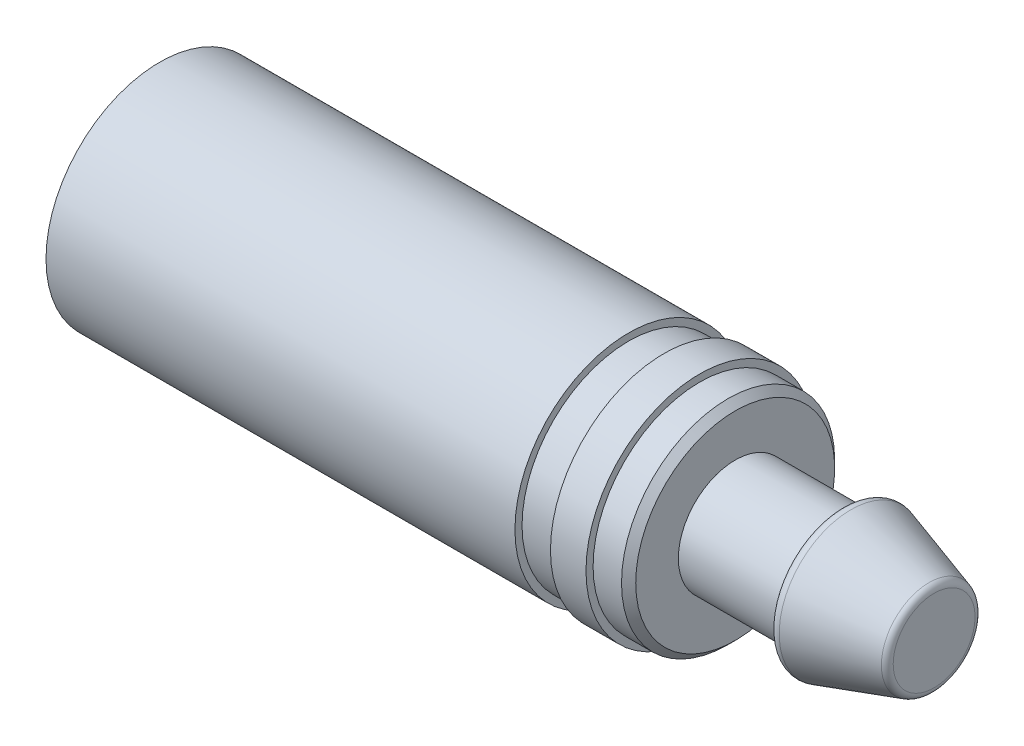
from build123d import *

# Parameters (mm, degrees)
REDONDEO1_R   = 1
CHAFL_N1_SIZE = 1


with BuildPart() as part:
    # Croquis1 → Revoluci_n1 (revolve)
    with BuildSketch(Plane.XY, mode=Mode.PRIVATE) as revoluci_n1_sk:
        Polygon((0, 0), (0, 16), (66, 16), (66, 15), (71, 15), (71, 16), (76, 16), (76, 15), (81, 15), (81, 8), (96, 8), (96, 10.5), (109, 6.5), (109, 0), align=None)
    revolve(revoluci_n1_sk.sketch.rotate(Axis((0, 0, 0), (1, 0, 0)), 90), axis=Axis((0, 0, 0), (1, 0, 0)))

    # Redondeo1
    redondeo1_edges = [part.edges().sort_by_distance(p)[0] for p in [
        (96, 0, -10.5),
        (109, 0, -6.5),
    ]]
    fillet(redondeo1_edges, radius=REDONDEO1_R)

    # Chafl_n1
    chafl_n1_edges = [part.edges().sort_by_distance(p)[0] for p in [
        (81, 0, -15),
    ]]
    chamfer(chafl_n1_edges, length=CHAFL_N1_SIZE)


solid = part.part
